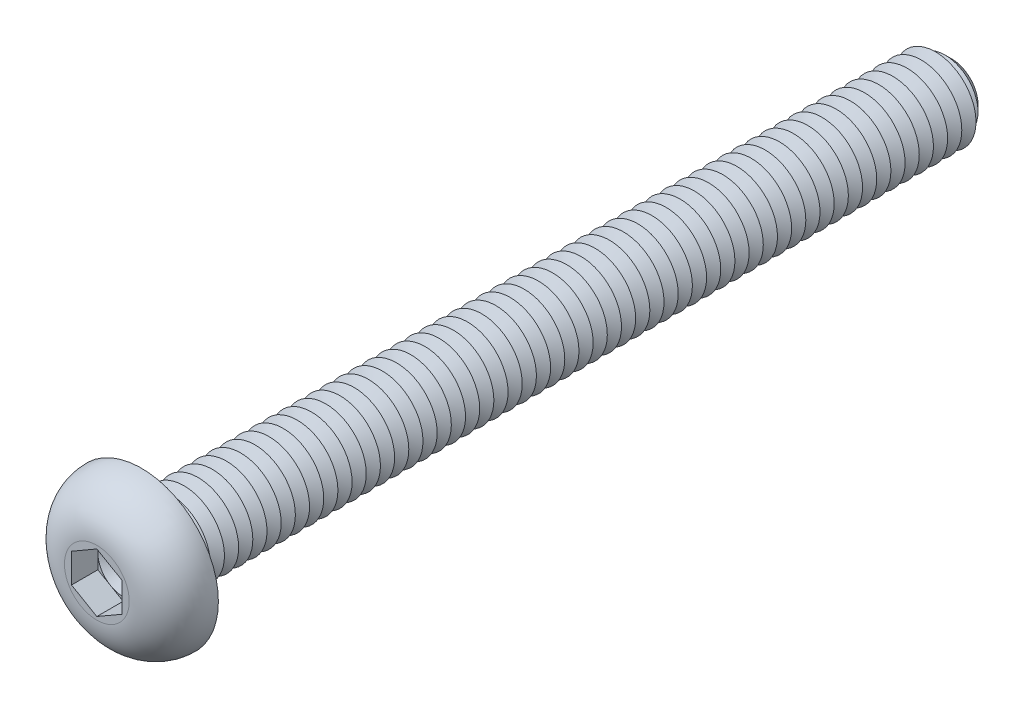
from build123d import *

# Parameters (mm, degrees)
CUT_EXTRUDE1_DEPTH  = 1.3
SKETCH4_R           = 2
BOSS_EXTRUDE1_DEPTH = 40
CHAMFER1_SIZE       = 0.7
LPATTERN1_COUNT     = 56
LPATTERN1_PITCH     = 0.7
FILLET2_R           = 0.3


with BuildPart() as part:
    # Sketch2 → Revolve1 (revolve)
    with BuildSketch(Plane(origin=(0, 0, 0), x_dir=(0, 0, -1), z_dir=(1, 0, 0)), mode=Mode.PRIVATE) as revolve1_sk:
        with BuildLine():
            Line((0, 0), (-2.2, 0))
            Line((-2.2, 0), (-2.2, 1.6))
            ThreePointArc((-2.2, 1.6), (-1.555634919, 3.155634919), (0, 3.8))
            Line((0, 3.8), (0, 0))
        make_face()
    revolve(revolve1_sk.sketch.rotate(Axis((0, 0, 47.934239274), (0, 0, -1)), 90), axis=Axis((0, 0, 47.934239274), (0, 0, -1)))

    # Sketch3 → Cut-Extrude1 (cut)
    with BuildSketch(Plane.XY.offset(2.2)):
        Polygon((0, 1.443375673), (-1.25, 0.721687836), (-1.25, -0.721687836), (0, -1.443375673), (1.25, -0.721687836), (1.25, 0.721687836), align=None)
    extrude(amount=-CUT_EXTRUDE1_DEPTH, mode=Mode.SUBTRACT)

    # Sketch4 → Boss-Extrude1 (add)
    with BuildSketch(Plane(origin=(0, 0, 0), x_dir=(-1, 0, 0), z_dir=(0, 0, -1))):
        with Locations(Location((0, 0, 0), (0, 0, 180))):
            Circle(SKETCH4_R)
    extrude(amount=BOSS_EXTRUDE1_DEPTH)

    # Chamfer1
    chamfer1_edges = [part.edges().sort_by_distance(p)[0] for p in [
        (-2, 0, -40),
    ]]
    chamfer(chamfer1_edges, length=CHAMFER1_SIZE)

    # Sketch5 → Cut-Revolve1 (revolve, cut)
    with BuildSketch(Plane(origin=(0, 0, 0), x_dir=(0, 0, -1), z_dir=(1, 0, 0)), mode=Mode.PRIVATE) as cut_revolve1_sk:
        Polygon((0.7, 2), (1.4, 2), (1.05, 1.393782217), align=None)
    cut_revolve1 = revolve(cut_revolve1_sk.sketch.rotate(Axis((0, 0, 47.934239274), (0, 0, -1)), 90), axis=Axis((0, 0, 47.934239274), (0, 0, -1)), mode=Mode.SUBTRACT)

    # LPattern1: Cut-Revolve1 ×56
    with Locations(*[(0, 0, -i * LPATTERN1_PITCH) for i in range(1, LPATTERN1_COUNT)]):
        add(cut_revolve1, mode=Mode.SUBTRACT)

    # Fillet2
    fillet2_edges = [part.edges().sort_by_distance(p)[0] for p in [
        (-2, 0, 0),
    ]]
    fillet(fillet2_edges, radius=FILLET2_R)

    # Cut-Extrude2 cone 1 section (on through the dimple's axis) → Cut-Extrude2 (revolve, cut)
    with BuildSketch(Plane(origin=(0, 0, 0.9), x_dir=(0, -1, 0), z_dir=(1, 0, 0))):
        Polygon((0, 0), (1.25, 0), (0, 0.721687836), align=None)
    revolve(axis=Axis((0, 0, 0.9), (0, 0, -1)), mode=Mode.SUBTRACT)


solid = part.part
